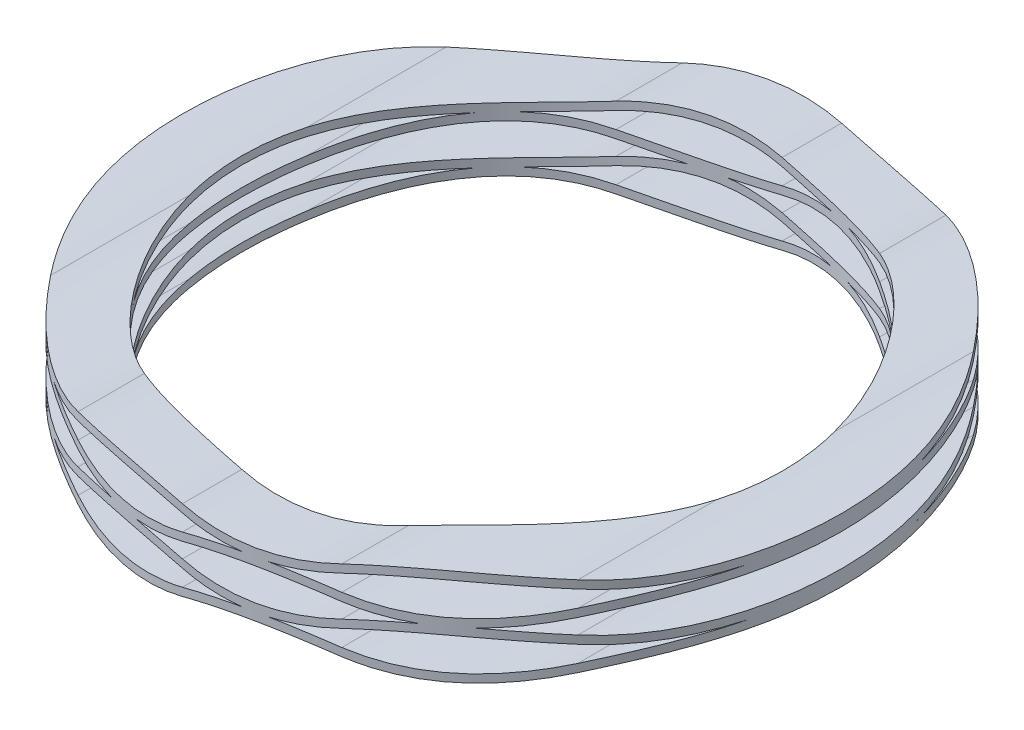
from build123d import *

# Parameters (mm, degrees)
EXTRUDE1_DEPTH      = 22.479
EXTRUDE1_DEPTH_BACK = 22.479
EXTRUDE2_DEPTH      = 22.479
EXTRUDE2_DEPTH_BACK = 22.479
EXTRUDE3_DEPTH      = 22.479
EXTRUDE3_DEPTH_BACK = 22.479
EXTRUDE4_DEPTH      = 22.479
EXTRUDE4_DEPTH_BACK = 22.479
SKETCH5_W           = 74.93
SKETCH5_H           = 74.93
SKETCH5_R           = 18.7325
EXTRUDE5_DEPTH      = 5.4864
SKETCH6_R           = 15.3543
EXTRUDE6_DEPTH      = 5.4864


with BuildPart() as part:
    # Sketch1 → Extrude1 (new, two sides: drawn at the far end of the back side and taken through both)
    with BuildSketch(Plane.XY.offset(-EXTRUDE1_DEPTH_BACK)):
        with BuildLine():
            Line((22.479, 0.4572), (22.479, 0.9144))
            ThreePointArc((22.479, 0.9144), (18.7325, 1.397), (14.986, 0.9144))
            ThreePointArc((14.986, 0.9144), (11.2395, 0.4572), (7.493, 0.9144))
            ThreePointArc((7.493, 0.9144), (3.7465, 1.397), (0, 0.9144))
            ThreePointArc((0, 0.9144), (-3.7465, 0.4572), (-7.493, 0.9144))
            ThreePointArc((-7.493, 0.9144), (-11.2395, 1.397), (-14.986, 0.9144))
            ThreePointArc((-14.986, 0.9144), (-18.7325, 0.4572), (-22.479, 0.9144))
            Line((-22.479, 0.9144), (-22.479, 0.4572))
            ThreePointArc((-22.479, 0.4572), (-18.7325, 0), (-14.986, 0.4572))
            ThreePointArc((-14.986, 0.4572), (-11.2395, 0.9398), (-7.493, 0.4572))
            ThreePointArc((-7.493, 0.4572), (-3.7465, 0), (0, 0.4572))
            ThreePointArc((0, 0.4572), (3.7465, 0.9398), (7.493, 0.4572))
            ThreePointArc((7.493, 0.4572), (11.2395, 0), (14.986, 0.4572))
            ThreePointArc((14.986, 0.4572), (18.7325, 0.9398), (22.479, 0.4572))
        make_face()
    extrude(amount=EXTRUDE1_DEPTH + EXTRUDE1_DEPTH_BACK)

    # Sketch2 → Extrude2 (add, two sides: drawn at the far end of the back side and taken through both)
    with BuildSketch(Plane.XY.offset(-EXTRUDE2_DEPTH_BACK)):
        with BuildLine():
            Line((-22.479, 2.3114), (-22.479, 1.8542))
            ThreePointArc((-22.479, 1.8542), (-18.7325, 2.3114), (-14.986, 1.8542))
            ThreePointArc((-14.986, 1.8542), (-11.2395, 1.3716), (-7.493, 1.8542))
            ThreePointArc((-7.493, 1.8542), (-3.7465, 2.3114), (0, 1.8542))
            ThreePointArc((0, 1.8542), (3.7465, 1.3716), (7.493, 1.8542))
            ThreePointArc((7.493, 1.8542), (11.2395, 2.3114), (14.986, 1.8542))
            ThreePointArc((14.986, 1.8542), (18.7325, 1.3716), (22.479, 1.8542))
            Line((22.479, 1.8542), (22.479, 2.3114))
            ThreePointArc((22.479, 2.3114), (18.7325, 1.8288), (14.986, 2.3114))
            ThreePointArc((14.986, 2.3114), (11.2395, 2.7686), (7.493, 2.3114))
            ThreePointArc((7.493, 2.3114), (3.7465, 1.8288), (0, 2.3114))
            ThreePointArc((0, 2.3114), (-3.7465, 2.7686), (-7.493, 2.3114))
            ThreePointArc((-7.493, 2.3114), (-11.2395, 1.8288), (-14.986, 2.3114))
            ThreePointArc((-14.986, 2.3114), (-18.7325, 2.7686), (-22.479, 2.3114))
        make_face()
    extrude(amount=EXTRUDE2_DEPTH + EXTRUDE2_DEPTH_BACK)

    # Sketch3 → Extrude3 (add, two sides: drawn at the far end of the back side and taken through both)
    with BuildSketch(Plane.XY.offset(-EXTRUDE3_DEPTH_BACK)):
        with BuildLine():
            Line((22.479, 3.175), (22.479, 3.6322))
            ThreePointArc((22.479, 3.6322), (18.7325, 4.1148), (14.986, 3.6322))
            ThreePointArc((14.986, 3.6322), (11.2395, 3.175), (7.493, 3.6322))
            ThreePointArc((7.493, 3.6322), (3.7465, 4.1148), (0, 3.6322))
            ThreePointArc((0, 3.6322), (-3.7465, 3.175), (-7.493, 3.6322))
            ThreePointArc((-7.493, 3.6322), (-11.2395, 4.1148), (-14.986, 3.6322))
            ThreePointArc((-14.986, 3.6322), (-18.7325, 3.175), (-22.479, 3.6322))
            Line((-22.479, 3.6322), (-22.479, 3.175))
            ThreePointArc((-22.479, 3.175), (-18.7325, 2.7178), (-14.986, 3.175))
            ThreePointArc((-14.986, 3.175), (-11.2395, 3.6576), (-7.493, 3.175))
            ThreePointArc((-7.493, 3.175), (-3.7465, 2.7178), (0, 3.175))
            ThreePointArc((0, 3.175), (3.7465, 3.6576), (7.493, 3.175))
            ThreePointArc((7.493, 3.175), (11.2395, 2.7178), (14.986, 3.175))
            ThreePointArc((14.986, 3.175), (18.7325, 3.6576), (22.479, 3.175))
        make_face()
    extrude(amount=EXTRUDE3_DEPTH + EXTRUDE3_DEPTH_BACK)

    # Sketch4 → Extrude4 (add, two sides: drawn at the far end of the back side and taken through both)
    with BuildSketch(Plane.XY.offset(-EXTRUDE4_DEPTH_BACK)):
        with BuildLine():
            Line((-22.479, 5.0292), (-22.479, 4.572))
            ThreePointArc((-22.479, 4.572), (-18.7325, 5.0292), (-14.986, 4.572))
            ThreePointArc((-14.986, 4.572), (-11.2395, 4.0894), (-7.493, 4.572))
            ThreePointArc((-7.493, 4.572), (-3.7465, 5.0292), (0, 4.572))
            ThreePointArc((0, 4.572), (3.7465, 4.0894), (7.493, 4.572))
            ThreePointArc((7.493, 4.572), (11.2395, 5.0292), (14.986, 4.572))
            ThreePointArc((14.986, 4.572), (18.7325, 4.0894), (22.479, 4.572))
            Line((22.479, 4.572), (22.479, 5.0292))
            ThreePointArc((22.479, 5.0292), (18.7325, 4.5466), (14.986, 5.0292))
            ThreePointArc((14.986, 5.0292), (11.2395, 5.4864), (7.493, 5.0292))
            ThreePointArc((7.493, 5.0292), (3.7465, 4.5466), (0, 5.0292))
            ThreePointArc((0, 5.0292), (-3.7465, 5.4864), (-7.493, 5.0292))
            ThreePointArc((-7.493, 5.0292), (-11.2395, 4.5466), (-14.986, 5.0292))
            ThreePointArc((-14.986, 5.0292), (-18.7325, 5.4864), (-22.479, 5.0292))
        make_face()
    extrude(amount=EXTRUDE4_DEPTH + EXTRUDE4_DEPTH_BACK)

    # Sketch5 → Extrude5 (cut)
    with BuildSketch(Plane(origin=(0, 0, 0), x_dir=(-1, 0, 0), z_dir=(0, 1, 0))):
        Rectangle(SKETCH5_W, SKETCH5_H)
        with Locations(Location((0, 0, 0), (0, 0, 270))):
            Circle(SKETCH5_R, mode=Mode.SUBTRACT)
    extrude(amount=EXTRUDE5_DEPTH, mode=Mode.SUBTRACT)

    # Sketch6 → Extrude6 (cut)
    with BuildSketch(Plane(origin=(0, 0, 0), x_dir=(-1, 0, 0), z_dir=(0, 1, 0))):
        with Locations(Location((0, 0, 0), (0, 0, 270))):
            Circle(SKETCH6_R)
    extrude(amount=EXTRUDE6_DEPTH, mode=Mode.SUBTRACT)


solid = part.part
